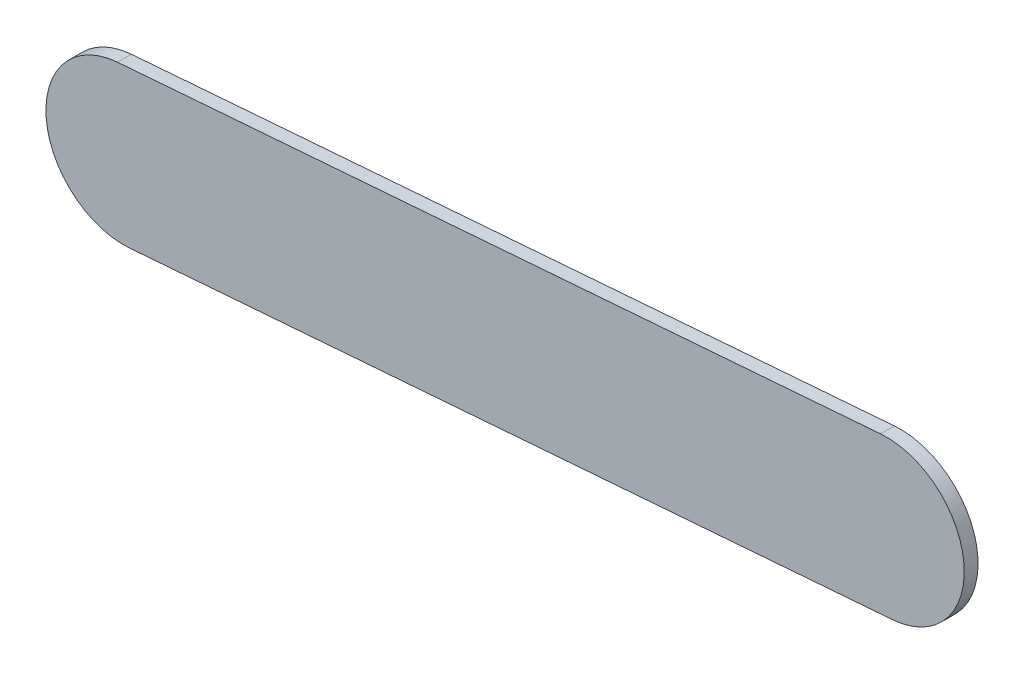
from build123d import *

# Parameters (mm, degrees)
BOSS_EXTRUDE1_DEPTH = 2.54


with BuildPart() as part:
    # Sketch1 → Boss-Extrude1 (new body)
    with BuildSketch(Plane.XY):
        with BuildLine():
            Line((-66.182990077, 3.278328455), (74.105090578, 14.244051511))
            ThreePointArc((74.105090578, 14.244051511), (89.462539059, 1.113396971), (76.33188452, -14.244051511))
            Line((76.33188452, -14.244051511), (-63.956196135, -25.209774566))
            ThreePointArc((-63.956196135, -25.209774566), (-79.313644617, -12.079120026), (-66.182990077, 3.278328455))
        make_face()
    extrude(amount=BOSS_EXTRUDE1_DEPTH)


solid = part.part
